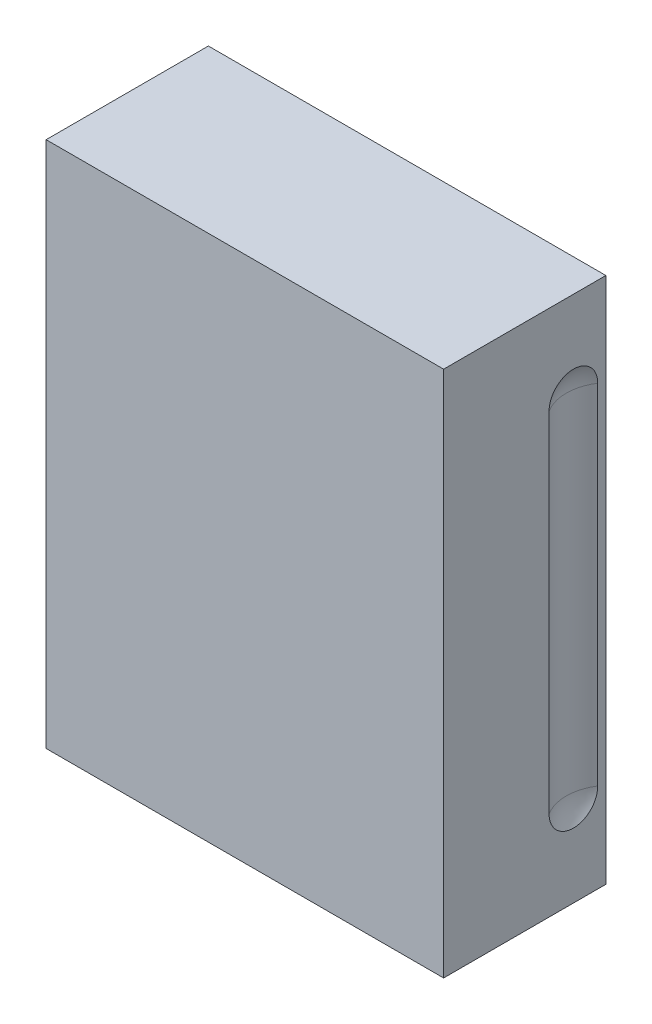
ISO-10303-21;
HEADER;
FILE_DESCRIPTION(('STEP AP214'),'2;1');
FILE_NAME('part.step','',(''),(''),'','','');
FILE_SCHEMA(('AUTOMOTIVE_DESIGN { 1 0 10303 214 1 1 1 1 }'));
ENDSEC;
DATA;
#1=APPLICATION_CONTEXT('core data for automotive mechanical design processes');
#2=APPLICATION_PROTOCOL_DEFINITION('international standard','automotive_design',2000,#1);
#3=PRODUCT_CONTEXT('',#1,'mechanical');
#4=PRODUCT('Part','Part','',(#3));
#5=PRODUCT_RELATED_PRODUCT_CATEGORY('part','',(#4));
#6=PRODUCT_DEFINITION_FORMATION('','',#4);
#7=PRODUCT_DEFINITION_CONTEXT('part definition',#1,'design');
#8=PRODUCT_DEFINITION('design','',#6,#7);
#9=PRODUCT_DEFINITION_SHAPE('','',#8);
#10=(LENGTH_UNIT() NAMED_UNIT(*) SI_UNIT(.MILLI.,.METRE.));
#11=(NAMED_UNIT(*) PLANE_ANGLE_UNIT() SI_UNIT($,.RADIAN.));
#12=(NAMED_UNIT(*) SI_UNIT($,.STERADIAN.) SOLID_ANGLE_UNIT());
#13=UNCERTAINTY_MEASURE_WITH_UNIT(LENGTH_MEASURE(1.E-05),#10,'distance_accuracy_value','');
#14=(GEOMETRIC_REPRESENTATION_CONTEXT(3) GLOBAL_UNCERTAINTY_ASSIGNED_CONTEXT((#13)) GLOBAL_UNIT_ASSIGNED_CONTEXT((#10,
#11,#12)) REPRESENTATION_CONTEXT('',''));
#15=CARTESIAN_POINT('',(0.,0.,0.));
#16=DIRECTION('',(0.,0.,1.));
#17=DIRECTION('',(1.,0.,0.));
#18=AXIS2_PLACEMENT_3D('',#15,#16,#17);
#19=CARTESIAN_POINT('',(49.,130.,20.));
#20=DIRECTION('',(0.,-1.,0.));
#21=DIRECTION('',(0.,0.,-1.));
#22=AXIS2_PLACEMENT_3D('',#19,#20,#21);
#23=PLANE('',#22);
#24=DIRECTION('',(-1.,0.,0.));
#25=VECTOR('',#24,1.);
#26=CARTESIAN_POINT('',(98.,130.,40.));
#27=LINE('',#26,#25);
#28=CARTESIAN_POINT('',(98.,130.,40.));
#29=VERTEX_POINT('',#28);
#30=CARTESIAN_POINT('',(0.,130.,40.));
#31=VERTEX_POINT('',#30);
#32=EDGE_CURVE('E128',#29,#31,#27,.T.);
#33=ORIENTED_EDGE('',*,*,#32,.F.);
#34=DIRECTION('',(0.,0.,1.));
#35=VECTOR('',#34,1.);
#36=CARTESIAN_POINT('',(98.,130.,20.));
#37=LINE('',#36,#35);
#38=CARTESIAN_POINT('',(98.,130.,0.));
#39=VERTEX_POINT('',#38);
#40=EDGE_CURVE('E164',#29,#39,#37,.F.);
#41=ORIENTED_EDGE('',*,*,#40,.T.);
#42=DIRECTION('',(1.,0.,0.));
#43=VECTOR('',#42,1.);
#44=CARTESIAN_POINT('',(49.,130.,0.));
#45=LINE('',#44,#43);
#46=CARTESIAN_POINT('',(0.,130.,0.));
#47=VERTEX_POINT('',#46);
#48=EDGE_CURVE('E246',#47,#39,#45,.T.);
#49=ORIENTED_EDGE('',*,*,#48,.F.);
#50=DIRECTION('',(0.,0.,-1.));
#51=VECTOR('',#50,1.);
#52=CARTESIAN_POINT('',(0.,130.,20.));
#53=LINE('',#52,#51);
#54=EDGE_CURVE('E144',#47,#31,#53,.F.);
#55=ORIENTED_EDGE('',*,*,#54,.T.);
#56=EDGE_LOOP('',(#33,#41,#49,#55));
#57=FACE_BOUND('',#56,.T.);
#58=ADVANCED_FACE('F14',(#57),#23,.F.);
#59=CARTESIAN_POINT('',(0.,65.,20.));
#60=DIRECTION('',(1.,0.,0.));
#61=DIRECTION('',(0.,0.,-1.));
#62=AXIS2_PLACEMENT_3D('',#59,#60,#61);
#63=PLANE('',#62);
#64=DIRECTION('',(0.,1.,0.));
#65=VECTOR('',#64,1.);
#66=CARTESIAN_POINT('',(0.,65.,13.9978662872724));
#67=LINE('',#66,#65);
#68=CARTESIAN_POINT('',(0.,21.9978662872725,13.9978662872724));
#69=VERTEX_POINT('',#68);
#70=CARTESIAN_POINT('',(0.,108.002133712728,13.9978662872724));
#71=VERTEX_POINT('',#70);
#72=EDGE_CURVE('E248',#69,#71,#67,.T.);
#73=ORIENTED_EDGE('',*,*,#72,.F.);
#74=CARTESIAN_POINT('',(0.,21.9978662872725,2.00213371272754));
#75=CARTESIAN_POINT('',(0.,21.8291744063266,2.00211557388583));
#76=CARTESIAN_POINT('',(0.,21.6604851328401,2.00924971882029));
#77=CARTESIAN_POINT('',(0.,21.324313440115,2.03769157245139));
#78=CARTESIAN_POINT('',(0.,21.1568309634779,2.05899860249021));
#79=CARTESIAN_POINT('',(0.,20.8243750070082,2.11563533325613));
#80=CARTESIAN_POINT('',(0.,20.6593998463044,2.1509551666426));
#81=CARTESIAN_POINT('',(0.,20.3330116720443,2.23536054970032));
#82=CARTESIAN_POINT('',(0.,20.1715986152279,2.28444593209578));
#83=CARTESIAN_POINT('',(0.,19.8534338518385,2.39605139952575));
#84=CARTESIAN_POINT('',(0.,19.696683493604,2.45857532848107));
#85=CARTESIAN_POINT('',(0.,19.3889496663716,2.59663030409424));
#86=CARTESIAN_POINT('',(0.,19.2379683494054,2.67216614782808));
#87=CARTESIAN_POINT('',(0.,18.9429914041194,2.8356454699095));
#88=CARTESIAN_POINT('',(0.,18.7989918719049,2.9235819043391));
#89=CARTESIAN_POINT('',(0.,18.5188584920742,3.11130448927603));
#90=CARTESIAN_POINT('',(0.,18.3827275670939,3.21109500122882));
#91=CARTESIAN_POINT('',(0.,18.1194027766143,3.42175358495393));
#92=CARTESIAN_POINT('',(0.,17.9922058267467,3.53261780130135));
#93=CARTESIAN_POINT('',(0.,17.7475556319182,3.76470784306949));
#94=CARTESIAN_POINT('',(0.,17.630106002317,3.88593747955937));
#95=CARTESIAN_POINT('',(0.,17.405862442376,4.13783366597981));
#96=CARTESIAN_POINT('',(0.,17.299066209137,4.26849816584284));
#97=CARTESIAN_POINT('',(0.,17.0968221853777,4.53840849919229));
#98=CARTESIAN_POINT('',(0.,17.0013786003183,4.67765748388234));
#99=CARTESIAN_POINT('',(0.,16.8226015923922,4.96364347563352));
#100=CARTESIAN_POINT('',(0.,16.7392631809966,5.11037736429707));
#101=CARTESIAN_POINT('',(0.,16.5852133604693,5.4103987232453));
#102=CARTESIAN_POINT('',(0.,16.5145066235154,5.56368859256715));
#103=CARTESIAN_POINT('',(0.,16.3862886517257,5.87561339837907));
#104=CARTESIAN_POINT('',(0.,16.3287717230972,6.03424599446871));
#105=CARTESIAN_POINT('',(0.,16.2272842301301,6.35585112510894));
#106=CARTESIAN_POINT('',(0.,16.1833186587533,6.51882523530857));
#107=CARTESIAN_POINT('',(0.,16.109287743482,6.84784269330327));
#108=CARTESIAN_POINT('',(0.,16.0792177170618,7.01388498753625));
#109=CARTESIAN_POINT('',(0.,16.0331616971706,7.34797042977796));
#110=CARTESIAN_POINT('',(0.,16.0171806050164,7.51601425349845));
#111=CARTESIAN_POINT('',(0.,15.999435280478,7.85282542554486));
#112=CARTESIAN_POINT('',(0.,15.997668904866,8.0215926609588));
#113=CARTESIAN_POINT('',(0.,16.0083599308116,8.35867600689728));
#114=CARTESIAN_POINT('',(0.,16.0208173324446,8.52699211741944));
#115=CARTESIAN_POINT('',(0.,16.0598705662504,8.8620040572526));
#116=CARTESIAN_POINT('',(0.,16.0864687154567,9.02869961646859));
#117=CARTESIAN_POINT('',(0.,16.1536040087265,9.35919935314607));
#118=CARTESIAN_POINT('',(0.,16.1941363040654,9.52300451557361));
#119=CARTESIAN_POINT('',(0.,16.2888706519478,9.84667630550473));
#120=CARTESIAN_POINT('',(0.,16.3430775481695,10.0065415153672));
#121=CARTESIAN_POINT('',(0.,16.4647460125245,10.3210781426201));
#122=CARTESIAN_POINT('',(0.,16.5322026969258,10.4757514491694));
#123=CARTESIAN_POINT('',(0.,16.6799332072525,10.7789267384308));
#124=CARTESIAN_POINT('',(0.,16.760212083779,10.9274262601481));
#125=CARTESIAN_POINT('',(0.,16.9329649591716,11.2170793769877));
#126=CARTESIAN_POINT('',(0.,17.025434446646,11.3582356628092));
#127=CARTESIAN_POINT('',(0.,17.221965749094,11.6323019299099));
#128=CARTESIAN_POINT('',(0.,17.3260312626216,11.7652092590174));
#129=CARTESIAN_POINT('',(0.,17.5449499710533,12.0217357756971));
#130=CARTESIAN_POINT('',(0.,17.6597991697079,12.1453583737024));
#131=CARTESIAN_POINT('',(0.,17.8995297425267,12.3825190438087));
#132=CARTESIAN_POINT('',(0.,18.0244134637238,12.4960547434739));
#133=CARTESIAN_POINT('',(0.,18.2832538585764,12.7121618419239));
#134=CARTESIAN_POINT('',(0.,18.4172071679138,12.8147372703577));
#135=CARTESIAN_POINT('',(0.,18.6933712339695,13.0083097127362));
#136=CARTESIAN_POINT('',(0.,18.8355876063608,13.0992987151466));
#137=CARTESIAN_POINT('',(0.,19.1271283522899,13.2689369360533));
#138=CARTESIAN_POINT('',(0.,19.2764500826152,13.3475906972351));
#139=CARTESIAN_POINT('',(0.,19.5813380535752,13.4921107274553));
#140=CARTESIAN_POINT('',(0.,19.7369102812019,13.55796436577));
#141=CARTESIAN_POINT('',(0.,20.0529952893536,13.6762965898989));
#142=CARTESIAN_POINT('',(0.,20.2135061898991,13.7287801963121));
#143=CARTESIAN_POINT('',(0.,20.5381971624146,13.8199805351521));
#144=CARTESIAN_POINT('',(0.,20.7023729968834,13.8587123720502));
#145=CARTESIAN_POINT('',(0.,21.0333377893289,13.9222002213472));
#146=CARTESIAN_POINT('',(0.,21.2001254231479,13.9469630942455));
#147=CARTESIAN_POINT('',(0.,21.4723744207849,13.9757308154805));
#148=CARTESIAN_POINT('',(0.,21.5773999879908,13.9840369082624));
#149=CARTESIAN_POINT('',(0.,21.7875688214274,13.9951006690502));
#150=CARTESIAN_POINT('',(0.,21.8927116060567,13.9978674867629));
#151=CARTESIAN_POINT('',(0.,21.9978662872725,13.9978662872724));
#152=B_SPLINE_CURVE_WITH_KNOTS('',3,(#74,#75,#76,#77,#78,#79,#80,#81,#82,#83,#84,#85,#86,#87,
#88,#89,#90,#91,#92,#93,#94,#95,#96,#97,#98,#99,#100,#101,#102,#103,#104,#105,#106,#107,#108,
#109,#110,#111,#112,#113,#114,#115,#116,#117,#118,#119,#120,#121,#122,#123,#124,#125,#126,#127,
#128,#129,#130,#131,#132,#133,#134,#135,#136,#137,#138,#139,#140,#141,#142,#143,#144,#145,#146,
#147,#148,#149,#150,#151),.UNSPECIFIED.,.F.,.F.,(4,2,2,2,2,2,2,2,2,2,2,2,2,2,2,2,2,2,2,2,2,2,2,
2,2,2,2,2,2,2,2,2,2,2,2,2,2,2,4),(0.,0.505921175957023,1.01181812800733,1.51735947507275,
2.02289467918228,2.52857467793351,3.03444150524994,3.54002213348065,4.04578935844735,
4.55138110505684,5.05715954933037,5.56282842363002,6.06868403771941,6.57433059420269,
7.08016379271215,7.58577821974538,8.09157871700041,8.59720864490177,9.10301440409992,
9.60874389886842,10.1144733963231,10.6202857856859,11.1259223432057,11.6317382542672,
12.1373680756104,12.6431975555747,13.1488403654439,13.6546449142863,14.1602627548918,
14.6659992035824,15.171549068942,15.6774466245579,16.1831574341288,16.6893647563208,
17.1953817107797,17.7008411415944,18.2060521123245,18.5219783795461,18.8373823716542),.UNSPECIFIED.);
#153=CARTESIAN_POINT('',(0.,21.9978662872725,2.00213371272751));
#154=VERTEX_POINT('',#153);
#155=EDGE_CURVE('E249',#154,#69,#152,.T.);
#156=ORIENTED_EDGE('',*,*,#155,.F.);
#157=DIRECTION('',(0.,1.,0.));
#158=VECTOR('',#157,1.);
#159=CARTESIAN_POINT('',(0.,65.,2.0021337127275));
#160=LINE('',#159,#158);
#161=CARTESIAN_POINT('',(0.,108.002133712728,2.00213371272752));
#162=VERTEX_POINT('',#161);
#163=EDGE_CURVE('E160',#162,#154,#160,.F.);
#164=ORIENTED_EDGE('',*,*,#163,.F.);
#165=CARTESIAN_POINT('',(0.,108.002133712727,13.9978662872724));
#166=CARTESIAN_POINT('',(0.,108.170825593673,13.9978844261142));
#167=CARTESIAN_POINT('',(0.,108.33951486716,13.9907502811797));
#168=CARTESIAN_POINT('',(0.,108.675686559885,13.9623084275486));
#169=CARTESIAN_POINT('',(0.,108.843169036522,13.9410013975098));
#170=CARTESIAN_POINT('',(0.,109.175624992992,13.8843646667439));
#171=CARTESIAN_POINT('',(0.,109.340600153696,13.8490448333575));
#172=CARTESIAN_POINT('',(0.,109.666988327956,13.7646394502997));
#173=CARTESIAN_POINT('',(0.,109.828401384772,13.7155540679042));
#174=CARTESIAN_POINT('',(0.,110.146566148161,13.6039486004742));
#175=CARTESIAN_POINT('',(0.,110.303316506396,13.541424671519));
#176=CARTESIAN_POINT('',(0.,110.611050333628,13.4033696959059));
#177=CARTESIAN_POINT('',(0.,110.762031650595,13.327833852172));
#178=CARTESIAN_POINT('',(0.,111.057008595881,13.1643545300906));
#179=CARTESIAN_POINT('',(0.,111.201008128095,13.076418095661));
#180=CARTESIAN_POINT('',(0.,111.481141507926,12.888695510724));
#181=CARTESIAN_POINT('',(0.,111.617272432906,12.7889049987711));
#182=CARTESIAN_POINT('',(0.,111.880597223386,12.578246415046));
#183=CARTESIAN_POINT('',(0.,112.007794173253,12.4673821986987));
#184=CARTESIAN_POINT('',(0.,112.252444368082,12.2352921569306));
#185=CARTESIAN_POINT('',(0.,112.369893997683,12.1140625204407));
#186=CARTESIAN_POINT('',(0.,112.594137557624,11.8621663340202));
#187=CARTESIAN_POINT('',(0.,112.700933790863,11.7315018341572));
#188=CARTESIAN_POINT('',(0.,112.903177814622,11.4615915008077));
#189=CARTESIAN_POINT('',(0.,112.998621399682,11.3223425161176));
#190=CARTESIAN_POINT('',(0.,113.177398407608,11.0363565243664));
#191=CARTESIAN_POINT('',(0.,113.260736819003,10.8896226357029));
#192=CARTESIAN_POINT('',(0.,113.414786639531,10.5896012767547));
#193=CARTESIAN_POINT('',(0.,113.485493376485,10.4363114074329));
#194=CARTESIAN_POINT('',(0.,113.613711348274,10.1243866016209));
#195=CARTESIAN_POINT('',(0.,113.671228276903,9.96575400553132));
#196=CARTESIAN_POINT('',(0.,113.77271576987,9.64414887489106));
#197=CARTESIAN_POINT('',(0.,113.816681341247,9.48117476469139));
#198=CARTESIAN_POINT('',(0.,113.890712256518,9.15215730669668));
#199=CARTESIAN_POINT('',(0.,113.920782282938,8.98611501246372));
#200=CARTESIAN_POINT('',(0.,113.96683830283,8.65202957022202));
#201=CARTESIAN_POINT('',(0.,113.982819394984,8.48398574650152));
#202=CARTESIAN_POINT('',(0.,114.000564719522,8.1471745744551));
#203=CARTESIAN_POINT('',(0.,114.002331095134,7.97840733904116));
#204=CARTESIAN_POINT('',(0.,113.991640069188,7.64132399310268));
#205=CARTESIAN_POINT('',(0.,113.979182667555,7.47300788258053));
#206=CARTESIAN_POINT('',(0.,113.94012943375,7.13799594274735));
#207=CARTESIAN_POINT('',(0.,113.913531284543,6.97130038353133));
#208=CARTESIAN_POINT('',(0.,113.846395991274,6.64080064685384));
#209=CARTESIAN_POINT('',(0.,113.805863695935,6.47699548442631));
#210=CARTESIAN_POINT('',(0.,113.711129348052,6.15332369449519));
#211=CARTESIAN_POINT('',(0.,113.656922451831,5.99345848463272));
#212=CARTESIAN_POINT('',(0.,113.535253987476,5.67892185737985));
#213=CARTESIAN_POINT('',(0.,113.467797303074,5.52424855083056));
#214=CARTESIAN_POINT('',(0.,113.320066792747,5.22107326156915));
#215=CARTESIAN_POINT('',(0.,113.239787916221,5.07257373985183));
#216=CARTESIAN_POINT('',(0.,113.067035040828,4.78292062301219));
#217=CARTESIAN_POINT('',(0.,112.974565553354,4.64176433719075));
#218=CARTESIAN_POINT('',(0.,112.778034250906,4.36769807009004));
#219=CARTESIAN_POINT('',(0.,112.673968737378,4.23479074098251));
#220=CARTESIAN_POINT('',(0.,112.455050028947,3.97826422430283));
#221=CARTESIAN_POINT('',(0.,112.340200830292,3.85464162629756));
#222=CARTESIAN_POINT('',(0.,112.100470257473,3.61748095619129));
#223=CARTESIAN_POINT('',(0.,111.975586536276,3.50394525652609));
#224=CARTESIAN_POINT('',(0.,111.716746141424,3.28783815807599));
#225=CARTESIAN_POINT('',(0.,111.582792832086,3.18526272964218));
#226=CARTESIAN_POINT('',(0.,111.30662876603,2.99169028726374));
#227=CARTESIAN_POINT('',(0.,111.164412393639,2.9007012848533));
#228=CARTESIAN_POINT('',(0.,110.87287164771,2.73106306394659));
#229=CARTESIAN_POINT('',(0.,110.723549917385,2.6524093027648));
#230=CARTESIAN_POINT('',(0.,110.418661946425,2.50788927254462));
#231=CARTESIAN_POINT('',(0.,110.263089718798,2.44203563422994));
#232=CARTESIAN_POINT('',(0.,109.947004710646,2.32370341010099));
#233=CARTESIAN_POINT('',(0.,109.786493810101,2.27121980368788));
#234=CARTESIAN_POINT('',(0.,109.461802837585,2.18001946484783));
#235=CARTESIAN_POINT('',(0.,109.297627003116,2.14128762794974));
#236=CARTESIAN_POINT('',(0.,108.966662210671,2.07779977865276));
#237=CARTESIAN_POINT('',(0.,108.799874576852,2.05303690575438));
#238=CARTESIAN_POINT('',(0.,108.527625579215,2.02426918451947));
#239=CARTESIAN_POINT('',(0.,108.422600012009,2.01596309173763));
#240=CARTESIAN_POINT('',(0.,108.212431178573,2.0048993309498));
#241=CARTESIAN_POINT('',(0.,108.107288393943,2.00213251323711));
#242=CARTESIAN_POINT('',(0.,108.002133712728,2.00213371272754));
#243=B_SPLINE_CURVE_WITH_KNOTS('',3,(#165,#166,#167,#168,#169,#170,#171,#172,#173,#174,#175,
#176,#177,#178,#179,#180,#181,#182,#183,#184,#185,#186,#187,#188,#189,#190,#191,#192,#193,#194,
#195,#196,#197,#198,#199,#200,#201,#202,#203,#204,#205,#206,#207,#208,#209,#210,#211,#212,#213,
#214,#215,#216,#217,#218,#219,#220,#221,#222,#223,#224,#225,#226,#227,#228,#229,#230,#231,#232,
#233,#234,#235,#236,#237,#238,#239,#240,#241,#242),.UNSPECIFIED.,.F.,.F.,(4,2,2,2,2,2,2,2,2,2,2,
2,2,2,2,2,2,2,2,2,2,2,2,2,2,2,2,2,2,2,2,2,2,2,2,2,2,2,4),(0.,0.505921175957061,1.01181812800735,
1.51735947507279,2.02289467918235,2.5285746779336,3.03444150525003,3.54002213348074,
4.04578935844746,4.55138110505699,5.05715954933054,5.5628284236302,6.06868403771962,
6.57433059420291,7.08016379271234,7.58577821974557,8.09157871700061,8.597208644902,
9.10301440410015,9.60874389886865,10.1144733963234,10.6202857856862,11.1259223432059,
11.6317382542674,12.1373680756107,12.643197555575,13.1488403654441,13.6546449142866,
14.1602627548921,14.6659992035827,15.1715490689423,15.6774466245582,16.1831574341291,
16.6893647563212,17.1953817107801,17.7008411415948,18.2060521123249,18.5219783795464,
18.8373823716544),.UNSPECIFIED.);
#244=EDGE_CURVE('E151',#71,#162,#243,.T.);
#245=ORIENTED_EDGE('',*,*,#244,.F.);
#246=EDGE_LOOP('',(#73,#156,#164,#245));
#247=FACE_BOUND('',#246,.T.);
#248=DIRECTION('',(0.,-1.,0.));
#249=VECTOR('',#248,1.);
#250=CARTESIAN_POINT('',(0.,130.,40.));
#251=LINE('',#250,#249);
#252=CARTESIAN_POINT('',(0.,0.,40.));
#253=VERTEX_POINT('',#252);
#254=EDGE_CURVE('E299',#31,#253,#251,.T.);
#255=ORIENTED_EDGE('',*,*,#254,.F.);
#256=ORIENTED_EDGE('',*,*,#54,.F.);
#257=DIRECTION('',(0.,1.,0.));
#258=VECTOR('',#257,1.);
#259=CARTESIAN_POINT('',(0.,65.,0.));
#260=LINE('',#259,#258);
#261=CARTESIAN_POINT('',(0.,0.,0.));
#262=VERTEX_POINT('',#261);
#263=EDGE_CURVE('E135',#262,#47,#260,.T.);
#264=ORIENTED_EDGE('',*,*,#263,.F.);
#265=DIRECTION('',(0.,0.,1.));
#266=VECTOR('',#265,1.);
#267=CARTESIAN_POINT('',(0.,0.,20.));
#268=LINE('',#267,#266);
#269=EDGE_CURVE('E143',#262,#253,#268,.T.);
#270=ORIENTED_EDGE('',*,*,#269,.T.);
#271=EDGE_LOOP('',(#255,#256,#264,#270));
#272=FACE_BOUND('',#271,.T.);
#273=ADVANCED_FACE('F149',(#247,#272),#63,.F.);
#274=CARTESIAN_POINT('',(49.,0.,20.));
#275=DIRECTION('',(0.,1.,0.));
#276=DIRECTION('',(0.,0.,1.));
#277=AXIS2_PLACEMENT_3D('',#274,#275,#276);
#278=PLANE('',#277);
#279=DIRECTION('',(1.,0.,0.));
#280=VECTOR('',#279,1.);
#281=CARTESIAN_POINT('',(0.,0.,40.));
#282=LINE('',#281,#280);
#283=CARTESIAN_POINT('',(98.,0.,40.));
#284=VERTEX_POINT('',#283);
#285=EDGE_CURVE('E32',#253,#284,#282,.T.);
#286=ORIENTED_EDGE('',*,*,#285,.F.);
#287=ORIENTED_EDGE('',*,*,#269,.F.);
#288=DIRECTION('',(1.,0.,0.));
#289=VECTOR('',#288,1.);
#290=CARTESIAN_POINT('',(49.,0.,0.));
#291=LINE('',#290,#289);
#292=CARTESIAN_POINT('',(98.,0.,0.));
#293=VERTEX_POINT('',#292);
#294=EDGE_CURVE('E137',#293,#262,#291,.F.);
#295=ORIENTED_EDGE('',*,*,#294,.F.);
#296=DIRECTION('',(0.,0.,1.));
#297=VECTOR('',#296,1.);
#298=CARTESIAN_POINT('',(98.,0.,20.));
#299=LINE('',#298,#297);
#300=EDGE_CURVE('E9',#293,#284,#299,.T.);
#301=ORIENTED_EDGE('',*,*,#300,.T.);
#302=EDGE_LOOP('',(#286,#287,#295,#301));
#303=FACE_BOUND('',#302,.T.);
#304=ADVANCED_FACE('F153',(#303),#278,.F.);
#305=CARTESIAN_POINT('',(98.,65.,20.));
#306=DIRECTION('',(-1.,0.,0.));
#307=DIRECTION('',(0.,0.,1.));
#308=AXIS2_PLACEMENT_3D('',#305,#306,#307);
#309=PLANE('',#308);
#310=DIRECTION('',(0.,1.,0.));
#311=VECTOR('',#310,1.);
#312=CARTESIAN_POINT('',(98.,65.,2.0021337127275));
#313=LINE('',#312,#311);
#314=CARTESIAN_POINT('',(98.,21.9978662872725,2.00213371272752));
#315=VERTEX_POINT('',#314);
#316=CARTESIAN_POINT('',(98.,108.002133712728,2.00213371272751));
#317=VERTEX_POINT('',#316);
#318=EDGE_CURVE('E167',#315,#317,#313,.T.);
#319=ORIENTED_EDGE('',*,*,#318,.F.);
#320=CARTESIAN_POINT('',(98.,21.9978662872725,13.9978662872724));
#321=CARTESIAN_POINT('',(98.,21.8291744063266,13.9978844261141));
#322=CARTESIAN_POINT('',(98.,21.6604851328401,13.9907502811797));
#323=CARTESIAN_POINT('',(98.,21.324313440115,13.9623084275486));
#324=CARTESIAN_POINT('',(98.,21.1568309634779,13.9410013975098));
#325=CARTESIAN_POINT('',(98.,20.8243750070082,13.8843646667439));
#326=CARTESIAN_POINT('',(98.,20.6593998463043,13.8490448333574));
#327=CARTESIAN_POINT('',(98.,20.3330116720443,13.7646394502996));
#328=CARTESIAN_POINT('',(98.,20.1715986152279,13.7155540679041));
#329=CARTESIAN_POINT('',(98.,19.8534338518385,13.6039486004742));
#330=CARTESIAN_POINT('',(98.,19.696683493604,13.5414246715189));
#331=CARTESIAN_POINT('',(98.,19.3889496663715,13.4033696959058));
#332=CARTESIAN_POINT('',(98.,19.2379683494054,13.3278338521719));
#333=CARTESIAN_POINT('',(98.,18.9429914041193,13.1643545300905));
#334=CARTESIAN_POINT('',(98.,18.7989918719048,13.0764180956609));
#335=CARTESIAN_POINT('',(98.,18.5188584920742,12.888695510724));
#336=CARTESIAN_POINT('',(98.,18.3827275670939,12.7889049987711));
#337=CARTESIAN_POINT('',(98.,18.1194027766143,12.578246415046));
#338=CARTESIAN_POINT('',(98.,17.9922058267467,12.4673821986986));
#339=CARTESIAN_POINT('',(98.,17.7475556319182,12.2352921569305));
#340=CARTESIAN_POINT('',(98.,17.630106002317,12.1140625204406));
#341=CARTESIAN_POINT('',(98.,17.405862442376,11.8621663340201));
#342=CARTESIAN_POINT('',(98.,17.299066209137,11.7315018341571));
#343=CARTESIAN_POINT('',(98.,17.0968221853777,11.4615915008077));
#344=CARTESIAN_POINT('',(98.,17.0013786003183,11.3223425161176));
#345=CARTESIAN_POINT('',(98.,16.8226015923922,11.0363565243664));
#346=CARTESIAN_POINT('',(98.,16.7392631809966,10.8896226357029));
#347=CARTESIAN_POINT('',(98.,16.5852133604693,10.5896012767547));
#348=CARTESIAN_POINT('',(98.,16.5145066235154,10.4363114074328));
#349=CARTESIAN_POINT('',(98.,16.3862886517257,10.1243866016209));
#350=CARTESIAN_POINT('',(98.,16.3287717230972,9.96575400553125));
#351=CARTESIAN_POINT('',(98.,16.2272842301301,9.64414887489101));
#352=CARTESIAN_POINT('',(98.,16.1833186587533,9.48117476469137));
#353=CARTESIAN_POINT('',(98.,16.109287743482,9.15215730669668));
#354=CARTESIAN_POINT('',(98.,16.0792177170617,8.9861150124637));
#355=CARTESIAN_POINT('',(98.,16.0331616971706,8.65202957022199));
#356=CARTESIAN_POINT('',(98.,16.0171806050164,8.4839857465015));
#357=CARTESIAN_POINT('',(98.,15.999435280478,8.14717457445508));
#358=CARTESIAN_POINT('',(98.,15.9976689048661,7.97840733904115));
#359=CARTESIAN_POINT('',(98.,16.0083599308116,7.64132399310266));
#360=CARTESIAN_POINT('',(98.,16.0208173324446,7.4730078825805));
#361=CARTESIAN_POINT('',(98.,16.0598705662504,7.13799594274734));
#362=CARTESIAN_POINT('',(98.,16.0864687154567,6.97130038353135));
#363=CARTESIAN_POINT('',(98.,16.1536040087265,6.64080064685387));
#364=CARTESIAN_POINT('',(98.,16.1941363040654,6.47699548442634));
#365=CARTESIAN_POINT('',(98.,16.2888706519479,6.15332369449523));
#366=CARTESIAN_POINT('',(98.,16.3430775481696,5.99345848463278));
#367=CARTESIAN_POINT('',(98.,16.4647460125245,5.67892185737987));
#368=CARTESIAN_POINT('',(98.,16.5322026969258,5.52424855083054));
#369=CARTESIAN_POINT('',(98.,16.6799332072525,5.22107326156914));
#370=CARTESIAN_POINT('',(98.,16.760212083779,5.07257373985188));
#371=CARTESIAN_POINT('',(98.,16.9329649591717,4.78292062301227));
#372=CARTESIAN_POINT('',(98.,17.025434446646,4.6417643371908));
#373=CARTESIAN_POINT('',(98.,17.221965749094,4.36769807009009));
#374=CARTESIAN_POINT('',(98.,17.3260312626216,4.23479074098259));
#375=CARTESIAN_POINT('',(98.,17.5449499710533,3.97826422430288));
#376=CARTESIAN_POINT('',(98.,17.6597991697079,3.85464162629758));
#377=CARTESIAN_POINT('',(98.,17.8995297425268,3.6174809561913));
#378=CARTESIAN_POINT('',(98.,18.0244134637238,3.50394525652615));
#379=CARTESIAN_POINT('',(98.,18.2832538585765,3.28783815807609));
#380=CARTESIAN_POINT('',(98.,18.4172071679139,3.18526272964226));
#381=CARTESIAN_POINT('',(98.,18.6933712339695,2.99169028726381));
#382=CARTESIAN_POINT('',(98.,18.8355876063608,2.90070128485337));
#383=CARTESIAN_POINT('',(98.,19.1271283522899,2.73106306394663));
#384=CARTESIAN_POINT('',(98.,19.2764500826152,2.65240930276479));
#385=CARTESIAN_POINT('',(98.,19.5813380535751,2.50788927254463));
#386=CARTESIAN_POINT('',(98.,19.7369102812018,2.44203563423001));
#387=CARTESIAN_POINT('',(98.,20.0529952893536,2.3237034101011));
#388=CARTESIAN_POINT('',(98.,20.2135061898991,2.27121980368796));
#389=CARTESIAN_POINT('',(98.,20.5381971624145,2.18001946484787));
#390=CARTESIAN_POINT('',(98.,20.7023729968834,2.14128762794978));
#391=CARTESIAN_POINT('',(98.,21.0333377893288,2.07779977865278));
#392=CARTESIAN_POINT('',(98.,21.2001254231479,2.05303690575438));
#393=CARTESIAN_POINT('',(98.,21.4723744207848,2.02426918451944));
#394=CARTESIAN_POINT('',(98.,21.5773999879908,2.01596309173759));
#395=CARTESIAN_POINT('',(98.,21.7875688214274,2.00489933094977));
#396=CARTESIAN_POINT('',(98.,21.8927116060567,2.00213251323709));
#397=CARTESIAN_POINT('',(98.,21.9978662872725,2.00213371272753));
#398=B_SPLINE_CURVE_WITH_KNOTS('',3,(#320,#321,#322,#323,#324,#325,#326,#327,#328,#329,#330,
#331,#332,#333,#334,#335,#336,#337,#338,#339,#340,#341,#342,#343,#344,#345,#346,#347,#348,#349,
#350,#351,#352,#353,#354,#355,#356,#357,#358,#359,#360,#361,#362,#363,#364,#365,#366,#367,#368,
#369,#370,#371,#372,#373,#374,#375,#376,#377,#378,#379,#380,#381,#382,#383,#384,#385,#386,#387,
#388,#389,#390,#391,#392,#393,#394,#395,#396,#397),.UNSPECIFIED.,.F.,.F.,(4,2,2,2,2,2,2,2,2,2,2,
2,2,2,2,2,2,2,2,2,2,2,2,2,2,2,2,2,2,2,2,2,2,2,2,2,2,2,4),(0.,0.505921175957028,1.01181812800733,
1.51735947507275,2.02289467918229,2.52857467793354,3.03444150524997,3.54002213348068,
4.04578935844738,4.55138110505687,5.05715954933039,5.56282842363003,6.06868403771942,
6.57433059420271,7.08016379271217,7.5857782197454,8.09157871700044,8.5972086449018,
9.10301440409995,9.60874389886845,10.1144733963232,10.6202857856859,11.1259223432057,
11.6317382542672,12.1373680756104,12.6431975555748,13.1488403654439,13.6546449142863,
14.1602627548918,14.6659992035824,15.171549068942,15.6774466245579,16.1831574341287,
16.6893647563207,17.1953817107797,17.7008411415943,18.2060521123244,18.521978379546,
18.8373823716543),.UNSPECIFIED.);
#399=CARTESIAN_POINT('',(98.,21.9978662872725,13.9978662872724));
#400=VERTEX_POINT('',#399);
#401=EDGE_CURVE('E157',#400,#315,#398,.T.);
#402=ORIENTED_EDGE('',*,*,#401,.F.);
#403=DIRECTION('',(0.,1.,0.));
#404=VECTOR('',#403,1.);
#405=CARTESIAN_POINT('',(98.,65.,13.9978662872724));
#406=LINE('',#405,#404);
#407=CARTESIAN_POINT('',(98.,108.002133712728,13.9978662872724));
#408=VERTEX_POINT('',#407);
#409=EDGE_CURVE('E154',#408,#400,#406,.F.);
#410=ORIENTED_EDGE('',*,*,#409,.F.);
#411=CARTESIAN_POINT('',(98.,108.002133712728,2.00213371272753));
#412=CARTESIAN_POINT('',(98.,108.170825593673,2.00211557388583));
#413=CARTESIAN_POINT('',(98.,108.33951486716,2.00924971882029));
#414=CARTESIAN_POINT('',(98.,108.675686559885,2.03769157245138));
#415=CARTESIAN_POINT('',(98.,108.843169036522,2.0589986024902));
#416=CARTESIAN_POINT('',(98.,109.175624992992,2.11563533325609));
#417=CARTESIAN_POINT('',(98.,109.340600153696,2.15095516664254));
#418=CARTESIAN_POINT('',(98.,109.666988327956,2.23536054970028));
#419=CARTESIAN_POINT('',(98.,109.828401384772,2.28444593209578));
#420=CARTESIAN_POINT('',(98.,110.146566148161,2.39605139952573));
#421=CARTESIAN_POINT('',(98.,110.303316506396,2.458575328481));
#422=CARTESIAN_POINT('',(98.,110.611050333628,2.59663030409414));
#423=CARTESIAN_POINT('',(98.,110.762031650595,2.672166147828));
#424=CARTESIAN_POINT('',(98.,111.057008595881,2.83564546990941));
#425=CARTESIAN_POINT('',(98.,111.201008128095,2.92358190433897));
#426=CARTESIAN_POINT('',(98.,111.481141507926,3.11130448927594));
#427=CARTESIAN_POINT('',(98.,111.617272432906,3.2110950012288));
#428=CARTESIAN_POINT('',(98.,111.880597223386,3.42175358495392));
#429=CARTESIAN_POINT('',(98.,112.007794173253,3.53261780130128));
#430=CARTESIAN_POINT('',(98.,112.252444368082,3.76470784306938));
#431=CARTESIAN_POINT('',(98.,112.369893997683,3.88593747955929));
#432=CARTESIAN_POINT('',(98.,112.594137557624,4.13783366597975));
#433=CARTESIAN_POINT('',(98.,112.700933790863,4.26849816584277));
#434=CARTESIAN_POINT('',(98.,112.903177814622,4.53840849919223));
#435=CARTESIAN_POINT('',(98.,112.998621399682,4.67765748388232));
#436=CARTESIAN_POINT('',(98.,113.177398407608,4.9636434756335));
#437=CARTESIAN_POINT('',(98.,113.260736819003,5.11037736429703));
#438=CARTESIAN_POINT('',(98.,113.414786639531,5.41039872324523));
#439=CARTESIAN_POINT('',(98.,113.485493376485,5.56368859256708));
#440=CARTESIAN_POINT('',(98.,113.613711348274,5.87561339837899));
#441=CARTESIAN_POINT('',(98.,113.671228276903,6.03424599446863));
#442=CARTESIAN_POINT('',(98.,113.77271576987,6.35585112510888));
#443=CARTESIAN_POINT('',(98.,113.816681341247,6.51882523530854));
#444=CARTESIAN_POINT('',(98.,113.890712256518,6.84784269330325));
#445=CARTESIAN_POINT('',(98.,113.920782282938,7.01388498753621));
#446=CARTESIAN_POINT('',(98.,113.96683830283,7.34797042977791));
#447=CARTESIAN_POINT('',(98.,113.982819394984,7.51601425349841));
#448=CARTESIAN_POINT('',(98.,114.000564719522,7.85282542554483));
#449=CARTESIAN_POINT('',(98.,114.002331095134,8.02159266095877));
#450=CARTESIAN_POINT('',(98.,113.991640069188,8.35867600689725));
#451=CARTESIAN_POINT('',(98.,113.979182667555,8.5269921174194));
#452=CARTESIAN_POINT('',(98.,113.940129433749,8.86200405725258));
#453=CARTESIAN_POINT('',(98.,113.913531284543,9.02869961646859));
#454=CARTESIAN_POINT('',(98.,113.846395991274,9.3591993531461));
#455=CARTESIAN_POINT('',(98.,113.805863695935,9.52300451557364));
#456=CARTESIAN_POINT('',(98.,113.711129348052,9.84667630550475));
#457=CARTESIAN_POINT('',(98.,113.656922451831,10.0065415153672));
#458=CARTESIAN_POINT('',(98.,113.535253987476,10.3210781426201));
#459=CARTESIAN_POINT('',(98.,113.467797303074,10.4757514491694));
#460=CARTESIAN_POINT('',(98.,113.320066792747,10.7789267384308));
#461=CARTESIAN_POINT('',(98.,113.239787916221,10.9274262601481));
#462=CARTESIAN_POINT('',(98.,113.067035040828,11.2170793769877));
#463=CARTESIAN_POINT('',(98.,112.974565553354,11.3582356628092));
#464=CARTESIAN_POINT('',(98.,112.778034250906,11.6323019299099));
#465=CARTESIAN_POINT('',(98.,112.673968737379,11.7652092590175));
#466=CARTESIAN_POINT('',(98.,112.455050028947,12.0217357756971));
#467=CARTESIAN_POINT('',(98.,112.340200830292,12.1453583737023));
#468=CARTESIAN_POINT('',(98.,112.100470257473,12.3825190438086));
#469=CARTESIAN_POINT('',(98.,111.975586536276,12.4960547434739));
#470=CARTESIAN_POINT('',(98.,111.716746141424,12.712161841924));
#471=CARTESIAN_POINT('',(98.,111.582792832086,12.8147372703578));
#472=CARTESIAN_POINT('',(98.,111.30662876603,13.0083097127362));
#473=CARTESIAN_POINT('',(98.,111.164412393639,13.0992987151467));
#474=CARTESIAN_POINT('',(98.,110.87287164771,13.2689369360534));
#475=CARTESIAN_POINT('',(98.,110.723549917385,13.3475906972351));
#476=CARTESIAN_POINT('',(98.,110.418661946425,13.4921107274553));
#477=CARTESIAN_POINT('',(98.,110.263089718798,13.55796436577));
#478=CARTESIAN_POINT('',(98.,109.947004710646,13.676296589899));
#479=CARTESIAN_POINT('',(98.,109.786493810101,13.7287801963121));
#480=CARTESIAN_POINT('',(98.,109.461802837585,13.8199805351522));
#481=CARTESIAN_POINT('',(98.,109.297627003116,13.8587123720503));
#482=CARTESIAN_POINT('',(98.,108.966662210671,13.9222002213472));
#483=CARTESIAN_POINT('',(98.,108.799874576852,13.9469630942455));
#484=CARTESIAN_POINT('',(98.,108.527625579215,13.9757308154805));
#485=CARTESIAN_POINT('',(98.,108.422600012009,13.9840369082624));
#486=CARTESIAN_POINT('',(98.,108.212431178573,13.9951006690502));
#487=CARTESIAN_POINT('',(98.,108.107288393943,13.9978674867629));
#488=CARTESIAN_POINT('',(98.,108.002133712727,13.9978662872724));
#489=B_SPLINE_CURVE_WITH_KNOTS('',3,(#411,#412,#413,#414,#415,#416,#417,#418,#419,#420,#421,
#422,#423,#424,#425,#426,#427,#428,#429,#430,#431,#432,#433,#434,#435,#436,#437,#438,#439,#440,
#441,#442,#443,#444,#445,#446,#447,#448,#449,#450,#451,#452,#453,#454,#455,#456,#457,#458,#459,
#460,#461,#462,#463,#464,#465,#466,#467,#468,#469,#470,#471,#472,#473,#474,#475,#476,#477,#478,
#479,#480,#481,#482,#483,#484,#485,#486,#487,#488),.UNSPECIFIED.,.F.,.F.,(4,2,2,2,2,2,2,2,2,2,2,
2,2,2,2,2,2,2,2,2,2,2,2,2,2,2,2,2,2,2,2,2,2,2,2,2,2,2,4),(0.,0.505921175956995,1.01181812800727,
1.51735947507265,2.02289467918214,2.52857467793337,3.0344415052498,3.54002213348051,
4.04578935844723,4.55138110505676,5.05715954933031,5.56282842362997,6.06868403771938,
6.57433059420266,7.0801637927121,7.58577821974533,8.09157871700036,8.59720864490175,
9.1030144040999,9.6087438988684,10.1144733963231,10.6202857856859,11.1259223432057,
11.6317382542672,12.1373680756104,12.6431975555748,13.1488403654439,13.6546449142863,
14.1602627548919,14.6659992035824,15.171549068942,15.677446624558,16.1831574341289,
16.6893647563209,17.1953817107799,17.7008411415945,18.2060521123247,18.5219783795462,
18.8373823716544),.UNSPECIFIED.);
#490=EDGE_CURVE('E166',#317,#408,#489,.T.);
#491=ORIENTED_EDGE('',*,*,#490,.F.);
#492=EDGE_LOOP('',(#319,#402,#410,#491));
#493=FACE_BOUND('',#492,.T.);
#494=DIRECTION('',(0.,1.,0.));
#495=VECTOR('',#494,1.);
#496=CARTESIAN_POINT('',(98.,0.,40.));
#497=LINE('',#496,#495);
#498=EDGE_CURVE('E295',#284,#29,#497,.T.);
#499=ORIENTED_EDGE('',*,*,#498,.F.);
#500=ORIENTED_EDGE('',*,*,#300,.F.);
#501=DIRECTION('',(0.,1.,0.));
#502=VECTOR('',#501,1.);
#503=CARTESIAN_POINT('',(98.,65.,0.));
#504=LINE('',#503,#502);
#505=EDGE_CURVE('E24',#39,#293,#504,.F.);
#506=ORIENTED_EDGE('',*,*,#505,.F.);
#507=ORIENTED_EDGE('',*,*,#40,.F.);
#508=EDGE_LOOP('',(#499,#500,#506,#507));
#509=FACE_BOUND('',#508,.T.);
#510=ADVANCED_FACE('F16',(#493,#509),#309,.F.);
#511=CARTESIAN_POINT('',(49.0000000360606,65.,11.7));
#512=DIRECTION('',(0.,0.,1.));
#513=DIRECTION('',(1.,0.,0.));
#514=AXIS2_PLACEMENT_3D('',#511,#512,#513);
#515=PLANE('',#514);
#516=DIRECTION('',(0.,1.,0.));
#517=VECTOR('',#516,1.);
#518=CARTESIAN_POINT('',(61.,65.,11.7));
#519=LINE('',#518,#517);
#520=CARTESIAN_POINT('',(61.,43.2,11.7));
#521=VERTEX_POINT('',#520);
#522=CARTESIAN_POINT('',(61.,86.8,11.7));
#523=VERTEX_POINT('',#522);
#524=EDGE_CURVE('E122',#521,#523,#519,.T.);
#525=ORIENTED_EDGE('',*,*,#524,.F.);
#526=CARTESIAN_POINT('',(56.,43.2,11.7));
#527=DIRECTION('',(0.,0.,-1.));
#528=DIRECTION('',(-1.,0.,0.));
#529=AXIS2_PLACEMENT_3D('',#526,#527,#528);
#530=CIRCLE('',#529,5.);
#531=CARTESIAN_POINT('',(56.,38.2,11.7));
#532=VERTEX_POINT('',#531);
#533=EDGE_CURVE('E19',#532,#521,#530,.F.);
#534=ORIENTED_EDGE('',*,*,#533,.F.);
#535=DIRECTION('',(1.,0.,0.));
#536=VECTOR('',#535,1.);
#537=CARTESIAN_POINT('',(49.0000000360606,38.2,11.7));
#538=LINE('',#537,#536);
#539=CARTESIAN_POINT('',(42.,38.2,11.7));
#540=VERTEX_POINT('',#539);
#541=EDGE_CURVE('E195',#540,#532,#538,.T.);
#542=ORIENTED_EDGE('',*,*,#541,.F.);
#543=CARTESIAN_POINT('',(42.,43.2,11.7));
#544=DIRECTION('',(0.,0.,-1.));
#545=DIRECTION('',(-1.,0.,0.));
#546=AXIS2_PLACEMENT_3D('',#543,#544,#545);
#547=CIRCLE('',#546,5.);
#548=CARTESIAN_POINT('',(37.,43.2,11.7));
#549=VERTEX_POINT('',#548);
#550=EDGE_CURVE('E191',#549,#540,#547,.F.);
#551=ORIENTED_EDGE('',*,*,#550,.F.);
#552=DIRECTION('',(0.,1.,0.));
#553=VECTOR('',#552,1.);
#554=CARTESIAN_POINT('',(37.,65.,11.7));
#555=LINE('',#554,#553);
#556=CARTESIAN_POINT('',(37.,86.8,11.7));
#557=VERTEX_POINT('',#556);
#558=EDGE_CURVE('E187',#557,#549,#555,.F.);
#559=ORIENTED_EDGE('',*,*,#558,.F.);
#560=CARTESIAN_POINT('',(42.,86.8,11.7));
#561=DIRECTION('',(0.,0.,-1.));
#562=DIRECTION('',(-1.,0.,0.));
#563=AXIS2_PLACEMENT_3D('',#560,#561,#562);
#564=CIRCLE('',#563,5.);
#565=CARTESIAN_POINT('',(42.,91.8,11.7));
#566=VERTEX_POINT('',#565);
#567=EDGE_CURVE('E183',#566,#557,#564,.F.);
#568=ORIENTED_EDGE('',*,*,#567,.F.);
#569=DIRECTION('',(1.,0.,0.));
#570=VECTOR('',#569,1.);
#571=CARTESIAN_POINT('',(49.0000000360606,91.8,11.7));
#572=LINE('',#571,#570);
#573=CARTESIAN_POINT('',(56.,91.8,11.7));
#574=VERTEX_POINT('',#573);
#575=EDGE_CURVE('E179',#574,#566,#572,.F.);
#576=ORIENTED_EDGE('',*,*,#575,.F.);
#577=CARTESIAN_POINT('',(56.,86.8,11.7));
#578=DIRECTION('',(0.,0.,-1.));
#579=DIRECTION('',(-1.,0.,0.));
#580=AXIS2_PLACEMENT_3D('',#577,#578,#579);
#581=CIRCLE('',#580,5.);
#582=EDGE_CURVE('E176',#523,#574,#581,.F.);
#583=ORIENTED_EDGE('',*,*,#582,.F.);
#584=EDGE_LOOP('',(#525,#534,#542,#551,#559,#568,#576,#583));
#585=FACE_BOUND('',#584,.T.);
#586=ADVANCED_FACE('F287',(#585),#515,.F.);
#587=CARTESIAN_POINT('',(61.,65.,5.85));
#588=DIRECTION('',(-1.,0.,0.));
#589=DIRECTION('',(0.,0.,1.));
#590=AXIS2_PLACEMENT_3D('',#587,#588,#589);
#591=PLANE('',#590);
#592=DIRECTION('',(0.,0.,-1.));
#593=VECTOR('',#592,1.);
#594=CARTESIAN_POINT('',(61.,86.8,5.85));
#595=LINE('',#594,#593);
#596=CARTESIAN_POINT('',(61.,86.8,0.));
#597=VERTEX_POINT('',#596);
#598=EDGE_CURVE('E172',#597,#523,#595,.F.);
#599=ORIENTED_EDGE('',*,*,#598,.F.);
#600=DIRECTION('',(0.,1.,0.));
#601=VECTOR('',#600,1.);
#602=CARTESIAN_POINT('',(61.,65.,0.));
#603=LINE('',#602,#601);
#604=CARTESIAN_POINT('',(61.,43.2,0.));
#605=VERTEX_POINT('',#604);
#606=EDGE_CURVE('E243',#597,#605,#603,.F.);
#607=ORIENTED_EDGE('',*,*,#606,.T.);
#608=DIRECTION('',(0.,0.,-1.));
#609=VECTOR('',#608,1.);
#610=CARTESIAN_POINT('',(61.,43.2,5.85));
#611=LINE('',#610,#609);
#612=EDGE_CURVE('E196',#521,#605,#611,.T.);
#613=ORIENTED_EDGE('',*,*,#612,.F.);
#614=ORIENTED_EDGE('',*,*,#524,.T.);
#615=EDGE_LOOP('',(#599,#607,#613,#614));
#616=FACE_BOUND('',#615,.T.);
#617=ADVANCED_FACE('F365',(#616),#591,.T.);
#618=CARTESIAN_POINT('',(56.,43.2,11.7));
#619=DIRECTION('',(0.,0.,-1.));
#620=DIRECTION('',(-1.,0.,0.));
#621=AXIS2_PLACEMENT_3D('',#618,#619,#620);
#622=CYLINDRICAL_SURFACE('',#621,5.);
#623=ORIENTED_EDGE('',*,*,#612,.T.);
#624=CARTESIAN_POINT('',(56.,43.2,0.));
#625=DIRECTION('',(0.,0.,-1.));
#626=DIRECTION('',(-1.,0.,0.));
#627=AXIS2_PLACEMENT_3D('',#624,#625,#626);
#628=CIRCLE('',#627,5.);
#629=CARTESIAN_POINT('',(56.,38.2,0.));
#630=VERTEX_POINT('',#629);
#631=EDGE_CURVE('E242',#605,#630,#628,.T.);
#632=ORIENTED_EDGE('',*,*,#631,.T.);
#633=DIRECTION('',(0.,0.,1.));
#634=VECTOR('',#633,1.);
#635=CARTESIAN_POINT('',(56.,38.2,5.85));
#636=LINE('',#635,#634);
#637=EDGE_CURVE('E192',#532,#630,#636,.F.);
#638=ORIENTED_EDGE('',*,*,#637,.F.);
#639=ORIENTED_EDGE('',*,*,#533,.T.);
#640=EDGE_LOOP('',(#623,#632,#638,#639));
#641=FACE_BOUND('',#640,.T.);
#642=ADVANCED_FACE('F367',(#641),#622,.F.);
#643=CARTESIAN_POINT('',(49.0000000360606,38.2,5.85));
#644=DIRECTION('',(0.,1.,0.));
#645=DIRECTION('',(0.,0.,1.));
#646=AXIS2_PLACEMENT_3D('',#643,#644,#645);
#647=PLANE('',#646);
#648=ORIENTED_EDGE('',*,*,#637,.T.);
#649=DIRECTION('',(1.,0.,0.));
#650=VECTOR('',#649,1.);
#651=CARTESIAN_POINT('',(49.,38.2,0.));
#652=LINE('',#651,#650);
#653=CARTESIAN_POINT('',(42.,38.2,0.));
#654=VERTEX_POINT('',#653);
#655=EDGE_CURVE('E240',#630,#654,#652,.F.);
#656=ORIENTED_EDGE('',*,*,#655,.T.);
#657=DIRECTION('',(0.,0.,-1.));
#658=VECTOR('',#657,1.);
#659=CARTESIAN_POINT('',(42.,38.2,5.85));
#660=LINE('',#659,#658);
#661=EDGE_CURVE('E188',#540,#654,#660,.T.);
#662=ORIENTED_EDGE('',*,*,#661,.F.);
#663=ORIENTED_EDGE('',*,*,#541,.T.);
#664=EDGE_LOOP('',(#648,#656,#662,#663));
#665=FACE_BOUND('',#664,.T.);
#666=ADVANCED_FACE('F347',(#665),#647,.T.);
#667=CARTESIAN_POINT('',(42.,43.2,11.7));
#668=DIRECTION('',(0.,0.,-1.));
#669=DIRECTION('',(-1.,0.,0.));
#670=AXIS2_PLACEMENT_3D('',#667,#668,#669);
#671=CYLINDRICAL_SURFACE('',#670,5.);
#672=DIRECTION('',(0.,0.,-1.));
#673=VECTOR('',#672,1.);
#674=CARTESIAN_POINT('',(37.,43.2,5.85));
#675=LINE('',#674,#673);
#676=CARTESIAN_POINT('',(37.,43.2,0.));
#677=VERTEX_POINT('',#676);
#678=EDGE_CURVE('E184',#549,#677,#675,.T.);
#679=ORIENTED_EDGE('',*,*,#678,.F.);
#680=ORIENTED_EDGE('',*,*,#550,.T.);
#681=ORIENTED_EDGE('',*,*,#661,.T.);
#682=CARTESIAN_POINT('',(42.,43.2,0.));
#683=DIRECTION('',(0.,0.,-1.));
#684=DIRECTION('',(-1.,0.,0.));
#685=AXIS2_PLACEMENT_3D('',#682,#683,#684);
#686=CIRCLE('',#685,5.);
#687=EDGE_CURVE('E239',#654,#677,#686,.T.);
#688=ORIENTED_EDGE('',*,*,#687,.T.);
#689=EDGE_LOOP('',(#679,#680,#681,#688));
#690=FACE_BOUND('',#689,.T.);
#691=ADVANCED_FACE('F340',(#690),#671,.F.);
#692=CARTESIAN_POINT('',(37.,65.,5.85));
#693=DIRECTION('',(1.,0.,0.));
#694=DIRECTION('',(0.,0.,-1.));
#695=AXIS2_PLACEMENT_3D('',#692,#693,#694);
#696=PLANE('',#695);
#697=ORIENTED_EDGE('',*,*,#678,.T.);
#698=DIRECTION('',(0.,1.,0.));
#699=VECTOR('',#698,1.);
#700=CARTESIAN_POINT('',(37.,65.,0.));
#701=LINE('',#700,#699);
#702=CARTESIAN_POINT('',(37.,86.8,0.));
#703=VERTEX_POINT('',#702);
#704=EDGE_CURVE('E237',#677,#703,#701,.T.);
#705=ORIENTED_EDGE('',*,*,#704,.T.);
#706=DIRECTION('',(0.,0.,-1.));
#707=VECTOR('',#706,1.);
#708=CARTESIAN_POINT('',(37.,86.8,5.85));
#709=LINE('',#708,#707);
#710=EDGE_CURVE('E180',#557,#703,#709,.T.);
#711=ORIENTED_EDGE('',*,*,#710,.F.);
#712=ORIENTED_EDGE('',*,*,#558,.T.);
#713=EDGE_LOOP('',(#697,#705,#711,#712));
#714=FACE_BOUND('',#713,.T.);
#715=ADVANCED_FACE('F381',(#714),#696,.T.);
#716=CARTESIAN_POINT('',(42.,86.8,11.7));
#717=DIRECTION('',(0.,0.,-1.));
#718=DIRECTION('',(-1.,0.,0.));
#719=AXIS2_PLACEMENT_3D('',#716,#717,#718);
#720=CYLINDRICAL_SURFACE('',#719,5.);
#721=ORIENTED_EDGE('',*,*,#710,.T.);
#722=CARTESIAN_POINT('',(42.,86.8,0.));
#723=DIRECTION('',(0.,0.,-1.));
#724=DIRECTION('',(-1.,0.,0.));
#725=AXIS2_PLACEMENT_3D('',#722,#723,#724);
#726=CIRCLE('',#725,5.);
#727=CARTESIAN_POINT('',(42.,91.8,0.));
#728=VERTEX_POINT('',#727);
#729=EDGE_CURVE('E236',#703,#728,#726,.T.);
#730=ORIENTED_EDGE('',*,*,#729,.T.);
#731=DIRECTION('',(0.,0.,-1.));
#732=VECTOR('',#731,1.);
#733=CARTESIAN_POINT('',(42.,91.8,5.85));
#734=LINE('',#733,#732);
#735=EDGE_CURVE('E173',#566,#728,#734,.T.);
#736=ORIENTED_EDGE('',*,*,#735,.F.);
#737=ORIENTED_EDGE('',*,*,#567,.T.);
#738=EDGE_LOOP('',(#721,#730,#736,#737));
#739=FACE_BOUND('',#738,.T.);
#740=ADVANCED_FACE('F356',(#739),#720,.F.);
#741=CARTESIAN_POINT('',(49.0000000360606,91.8,5.85));
#742=DIRECTION('',(0.,-1.,0.));
#743=DIRECTION('',(0.,0.,-1.));
#744=AXIS2_PLACEMENT_3D('',#741,#742,#743);
#745=PLANE('',#744);
#746=ORIENTED_EDGE('',*,*,#735,.T.);
#747=DIRECTION('',(1.,0.,0.));
#748=VECTOR('',#747,1.);
#749=CARTESIAN_POINT('',(49.,91.8,0.));
#750=LINE('',#749,#748);
#751=CARTESIAN_POINT('',(56.,91.8,0.));
#752=VERTEX_POINT('',#751);
#753=EDGE_CURVE('E233',#728,#752,#750,.T.);
#754=ORIENTED_EDGE('',*,*,#753,.T.);
#755=DIRECTION('',(0.,0.,-1.));
#756=VECTOR('',#755,1.);
#757=CARTESIAN_POINT('',(56.,91.8,5.85));
#758=LINE('',#757,#756);
#759=EDGE_CURVE('E169',#574,#752,#758,.T.);
#760=ORIENTED_EDGE('',*,*,#759,.F.);
#761=ORIENTED_EDGE('',*,*,#575,.T.);
#762=EDGE_LOOP('',(#746,#754,#760,#761));
#763=FACE_BOUND('',#762,.T.);
#764=ADVANCED_FACE('F358',(#763),#745,.T.);
#765=CARTESIAN_POINT('',(56.,86.8,11.7));
#766=DIRECTION('',(0.,0.,-1.));
#767=DIRECTION('',(-1.,0.,0.));
#768=AXIS2_PLACEMENT_3D('',#765,#766,#767);
#769=CYLINDRICAL_SURFACE('',#768,5.);
#770=ORIENTED_EDGE('',*,*,#598,.T.);
#771=ORIENTED_EDGE('',*,*,#582,.T.);
#772=ORIENTED_EDGE('',*,*,#759,.T.);
#773=CARTESIAN_POINT('',(56.,86.8,0.));
#774=DIRECTION('',(0.,0.,-1.));
#775=DIRECTION('',(-1.,0.,0.));
#776=AXIS2_PLACEMENT_3D('',#773,#774,#775);
#777=CIRCLE('',#776,5.);
#778=EDGE_CURVE('E235',#752,#597,#777,.T.);
#779=ORIENTED_EDGE('',*,*,#778,.T.);
#780=EDGE_LOOP('',(#770,#771,#772,#779));
#781=FACE_BOUND('',#780,.T.);
#782=ADVANCED_FACE('F363',(#781),#769,.F.);
#783=CARTESIAN_POINT('',(-9.34,21.9978662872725,8.));
#784=DIRECTION('',(0.239060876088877,0.917518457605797,0.317820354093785));
#785=DIRECTION('',(-0.741776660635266,-0.0386490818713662,0.669532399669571));
#786=AXIS2_PLACEMENT_3D('',#783,#784,#785);
#787=SPHERICAL_SURFACE('',#786,11.1);
#788=CARTESIAN_POINT('',(-9.34,21.9978662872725,8.));
#789=DIRECTION('',(0.,-1.,0.));
#790=DIRECTION('',(0.,0.,-1.));
#791=AXIS2_PLACEMENT_3D('',#788,#789,#790);
#792=CIRCLE('',#791,11.1);
#793=EDGE_CURVE('E332',#69,#154,#792,.F.);
#794=ORIENTED_EDGE('',*,*,#793,.T.);
#795=ORIENTED_EDGE('',*,*,#155,.T.);
#796=EDGE_LOOP('',(#794,#795));
#797=FACE_BOUND('',#796,.T.);
#798=ADVANCED_FACE('F272',(#797),#787,.F.);
#799=CARTESIAN_POINT('',(-9.34,21.9978662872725,8.));
#800=DIRECTION('',(0.,-1.,0.));
#801=DIRECTION('',(0.,0.,-1.));
#802=AXIS2_PLACEMENT_3D('',#799,#800,#801);
#803=CYLINDRICAL_SURFACE('',#802,11.1);
#804=ORIENTED_EDGE('',*,*,#163,.T.);
#805=ORIENTED_EDGE('',*,*,#793,.F.);
#806=ORIENTED_EDGE('',*,*,#72,.T.);
#807=CARTESIAN_POINT('',(-9.34,108.002133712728,8.));
#808=DIRECTION('',(0.,-1.,0.));
#809=DIRECTION('',(0.,0.,-1.));
#810=AXIS2_PLACEMENT_3D('',#807,#808,#809);
#811=CIRCLE('',#810,11.1);
#812=EDGE_CURVE('E322',#71,#162,#811,.F.);
#813=ORIENTED_EDGE('',*,*,#812,.T.);
#814=EDGE_LOOP('',(#804,#805,#806,#813));
#815=FACE_BOUND('',#814,.T.);
#816=ADVANCED_FACE('F308',(#815),#803,.F.);
#817=CARTESIAN_POINT('',(-9.34,108.002133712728,8.));
#818=DIRECTION('',(0.239060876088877,0.917518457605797,0.317820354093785));
#819=DIRECTION('',(-0.741776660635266,-0.0386490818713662,0.669532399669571));
#820=AXIS2_PLACEMENT_3D('',#817,#818,#819);
#821=SPHERICAL_SURFACE('',#820,11.1);
#822=ORIENTED_EDGE('',*,*,#812,.F.);
#823=ORIENTED_EDGE('',*,*,#244,.T.);
#824=EDGE_LOOP('',(#822,#823));
#825=FACE_BOUND('',#824,.T.);
#826=ADVANCED_FACE('F304',(#825),#821,.F.);
#827=CARTESIAN_POINT('',(107.34,21.9978662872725,8.));
#828=DIRECTION('',(0.239060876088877,0.917518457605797,0.317820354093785));
#829=DIRECTION('',(-0.741776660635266,-0.0386490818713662,0.669532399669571));
#830=AXIS2_PLACEMENT_3D('',#827,#828,#829);
#831=SPHERICAL_SURFACE('',#830,11.1);
#832=CARTESIAN_POINT('',(107.34,21.9978662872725,8.));
#833=DIRECTION('',(0.,1.,0.));
#834=DIRECTION('',(0.,0.,1.));
#835=AXIS2_PLACEMENT_3D('',#832,#833,#834);
#836=CIRCLE('',#835,11.1);
#837=EDGE_CURVE('E319',#315,#400,#836,.T.);
#838=ORIENTED_EDGE('',*,*,#837,.T.);
#839=ORIENTED_EDGE('',*,*,#401,.T.);
#840=EDGE_LOOP('',(#838,#839));
#841=FACE_BOUND('',#840,.T.);
#842=ADVANCED_FACE('F307',(#841),#831,.F.);
#843=CARTESIAN_POINT('',(107.34,21.9978662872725,8.));
#844=DIRECTION('',(0.,1.,0.));
#845=DIRECTION('',(0.,0.,1.));
#846=AXIS2_PLACEMENT_3D('',#843,#844,#845);
#847=CYLINDRICAL_SURFACE('',#846,11.1);
#848=ORIENTED_EDGE('',*,*,#318,.T.);
#849=CARTESIAN_POINT('',(107.34,108.002133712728,8.));
#850=DIRECTION('',(0.,1.,0.));
#851=DIRECTION('',(0.,0.,1.));
#852=AXIS2_PLACEMENT_3D('',#849,#850,#851);
#853=CIRCLE('',#852,11.1);
#854=EDGE_CURVE('E245',#317,#408,#853,.T.);
#855=ORIENTED_EDGE('',*,*,#854,.T.);
#856=ORIENTED_EDGE('',*,*,#409,.T.);
#857=ORIENTED_EDGE('',*,*,#837,.F.);
#858=EDGE_LOOP('',(#848,#855,#856,#857));
#859=FACE_BOUND('',#858,.T.);
#860=ADVANCED_FACE('F225',(#859),#847,.F.);
#861=CARTESIAN_POINT('',(107.34,108.002133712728,8.));
#862=DIRECTION('',(0.239060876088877,0.917518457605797,0.317820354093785));
#863=DIRECTION('',(-0.741776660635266,-0.0386490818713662,0.669532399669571));
#864=AXIS2_PLACEMENT_3D('',#861,#862,#863);
#865=SPHERICAL_SURFACE('',#864,11.1);
#866=ORIENTED_EDGE('',*,*,#854,.F.);
#867=ORIENTED_EDGE('',*,*,#490,.T.);
#868=EDGE_LOOP('',(#866,#867));
#869=FACE_BOUND('',#868,.T.);
#870=ADVANCED_FACE('F219',(#869),#865,.F.);
#871=CARTESIAN_POINT('',(49.,65.,0.));
#872=DIRECTION('',(0.,0.,1.));
#873=DIRECTION('',(1.,0.,0.));
#874=AXIS2_PLACEMENT_3D('',#871,#872,#873);
#875=PLANE('',#874);
#876=ORIENTED_EDGE('',*,*,#263,.T.);
#877=ORIENTED_EDGE('',*,*,#48,.T.);
#878=ORIENTED_EDGE('',*,*,#505,.T.);
#879=ORIENTED_EDGE('',*,*,#294,.T.);
#880=EDGE_LOOP('',(#876,#877,#878,#879));
#881=FACE_BOUND('',#880,.T.);
#882=ORIENTED_EDGE('',*,*,#753,.F.);
#883=ORIENTED_EDGE('',*,*,#729,.F.);
#884=ORIENTED_EDGE('',*,*,#704,.F.);
#885=ORIENTED_EDGE('',*,*,#687,.F.);
#886=ORIENTED_EDGE('',*,*,#655,.F.);
#887=ORIENTED_EDGE('',*,*,#631,.F.);
#888=ORIENTED_EDGE('',*,*,#606,.F.);
#889=ORIENTED_EDGE('',*,*,#778,.F.);
#890=EDGE_LOOP('',(#882,#883,#884,#885,#886,#887,#888,#889));
#891=FACE_BOUND('',#890,.T.);
#892=ADVANCED_FACE('F138',(#881,#891),#875,.F.);
#893=CARTESIAN_POINT('',(0.,0.,40.));
#894=DIRECTION('',(0.,0.,1.));
#895=DIRECTION('',(1.,0.,0.));
#896=AXIS2_PLACEMENT_3D('',#893,#894,#895);
#897=PLANE('',#896);
#898=ORIENTED_EDGE('',*,*,#254,.T.);
#899=ORIENTED_EDGE('',*,*,#285,.T.);
#900=ORIENTED_EDGE('',*,*,#498,.T.);
#901=ORIENTED_EDGE('',*,*,#32,.T.);
#902=EDGE_LOOP('',(#898,#899,#900,#901));
#903=FACE_BOUND('',#902,.T.);
#904=ADVANCED_FACE('F438',(#903),#897,.T.);
#905=CLOSED_SHELL('',(#58,#273,#304,#510,#586,#617,#642,#666,#691,#715,#740,#764,#782,#798,#816,
#826,#842,#860,#870,#892,#904));
#906=MANIFOLD_SOLID_BREP('B1',#905);
#907=ADVANCED_BREP_SHAPE_REPRESENTATION('',(#18,#906),#14);
#908=SHAPE_DEFINITION_REPRESENTATION(#9,#907);
ENDSEC;
END-ISO-10303-21;
